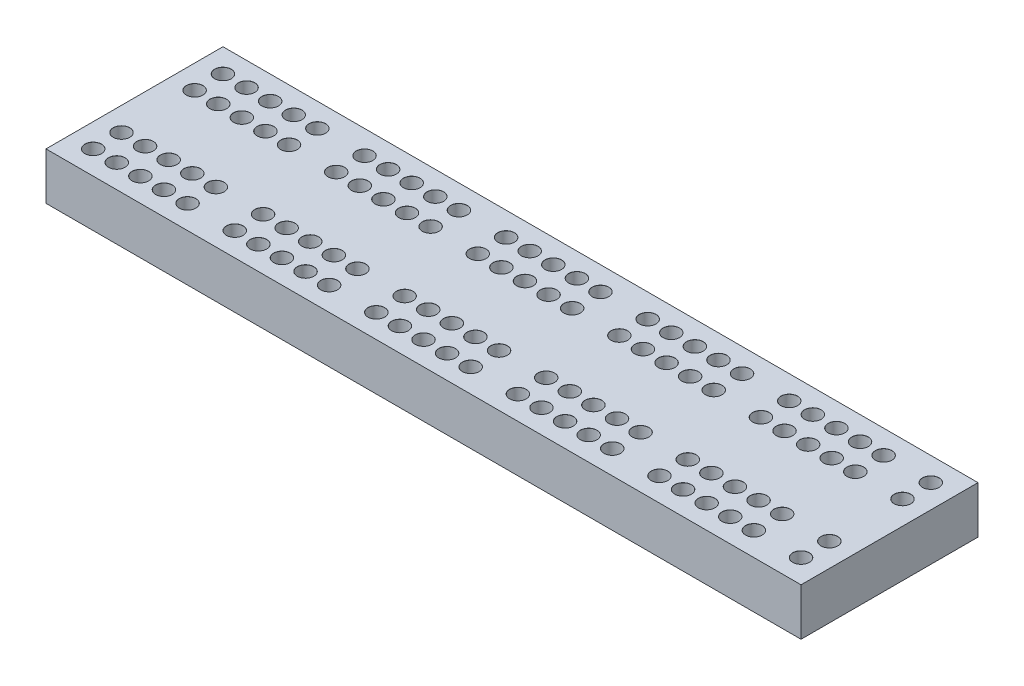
from build123d import *

# Parameters (mm, degrees)
SKETCH1_W            = 320
SKETCH1_H            = 75
BOSS_EXTRUDE1_DEPTH  = 20
LPATTERN1_COUNT      = 2
LPATTERN1_PITCH      = 12
LPATTERN1_COUNT_DIR2 = 5
LPATTERN1_PITCH_DIR2 = 10
LPATTERN3_COUNT      = 5
LPATTERN3_PITCH      = 60
LPATTERN4_COUNT      = 2
LPATTERN4_PITCH      = 300
LPATTERN4_COUNT_DIR2 = 2
LPATTERN4_PITCH_DIR2 = 12


with BuildPart() as part:
    # Sketch1 → Boss-Extrude1 (new body)
    with BuildSketch(Plane(origin=(0, 0, 0), x_dir=(1, 0, 0), z_dir=(0, 1, 0))):
        Rectangle(SKETCH1_W, SKETCH1_H)
    extrude(amount=BOSS_EXTRUDE1_DEPTH)

    # Sketch4 → 7.0 _7_ Diameter Hole1 (revolve, cut)
    with BuildSketch(Plane(origin=(-150, 20, -27.5), x_dir=(0, 0, 1), z_dir=(1, 0, 0))):
        Polygon((0, 0), (0, 14.103012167), (3.5, 12), (3.5, 0.025), (3.525, 0), align=None)
    f_7_0_7_diameter_hole1 = revolve(axis=Axis((-150, 26.35, -27.5), (0, -1, 0)), mode=Mode.SUBTRACT)

    # LPattern1: 7.0 _7_ Diameter Hole1 2 × 5
    with Locations(*[(j * LPATTERN1_PITCH_DIR2, 0, i * LPATTERN1_PITCH) for i in range(LPATTERN1_COUNT) for j in range(LPATTERN1_COUNT_DIR2) if (i, j) != (0, 0)]):
        add(f_7_0_7_diameter_hole1, mode=Mode.SUBTRACT)

    # LPattern3: 7.0 _7_ Diameter Hole1 ×5
    with Locations(*[(i * LPATTERN3_PITCH, 0, 0) for i in range(1, LPATTERN3_COUNT)]):
        add(f_7_0_7_diameter_hole1, mode=Mode.SUBTRACT)

    # LPattern3 copy 1 sketch → LPattern3 copy 1 (revolve, cut)
    with BuildSketch(Plane(origin=(-80, 20, -27.5), x_dir=(0, 0, 1), z_dir=(1, 0, 0))):
        Polygon((0, 0), (0, 14.103012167), (3.5, 12), (3.5, 0.025), (3.525, 0), align=None)
    revolve(axis=Axis((-80, 26.35, -27.5), (0, -1, 0)), mode=Mode.SUBTRACT)

    # LPattern3 copy 2 sketch → LPattern3 copy 2 (revolve, cut)
    with BuildSketch(Plane(origin=(-20, 20, -27.5), x_dir=(0, 0, 1), z_dir=(1, 0, 0))):
        Polygon((0, 0), (0, 14.103012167), (3.5, 12), (3.5, 0.025), (3.525, 0), align=None)
    revolve(axis=Axis((-20, 26.35, -27.5), (0, -1, 0)), mode=Mode.SUBTRACT)

    # LPattern3 copy 3 sketch → LPattern3 copy 3 (revolve, cut)
    with BuildSketch(Plane(origin=(40, 20, -27.5), x_dir=(0, 0, 1), z_dir=(1, 0, 0))):
        Polygon((0, 0), (0, 14.103012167), (3.5, 12), (3.5, 0.025), (3.525, 0), align=None)
    revolve(axis=Axis((40, 26.35, -27.5), (0, -1, 0)), mode=Mode.SUBTRACT)

    # LPattern3 copy 4 sketch → LPattern3 copy 4 (revolve, cut)
    with BuildSketch(Plane(origin=(100, 20, -27.5), x_dir=(0, 0, 1), z_dir=(1, 0, 0))):
        Polygon((0, 0), (0, 14.103012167), (3.5, 12), (3.5, 0.025), (3.525, 0), align=None)
    revolve(axis=Axis((100, 26.35, -27.5), (0, -1, 0)), mode=Mode.SUBTRACT)

    # LPattern3 copy 5 sketch → LPattern3 copy 5 (revolve, cut)
    with BuildSketch(Plane(origin=(-70, 20, -27.5), x_dir=(0, 0, 1), z_dir=(1, 0, 0))):
        Polygon((0, 0), (0, 14.103012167), (3.5, 12), (3.5, 0.025), (3.525, 0), align=None)
    revolve(axis=Axis((-70, 26.35, -27.5), (0, -1, 0)), mode=Mode.SUBTRACT)

    # LPattern3 copy 6 sketch → LPattern3 copy 6 (revolve, cut)
    with BuildSketch(Plane(origin=(-10, 20, -27.5), x_dir=(0, 0, 1), z_dir=(1, 0, 0))):
        Polygon((0, 0), (0, 14.103012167), (3.5, 12), (3.5, 0.025), (3.525, 0), align=None)
    revolve(axis=Axis((-10, 26.35, -27.5), (0, -1, 0)), mode=Mode.SUBTRACT)

    # LPattern3 copy 7 sketch → LPattern3 copy 7 (revolve, cut)
    with BuildSketch(Plane(origin=(50, 20, -27.5), x_dir=(0, 0, 1), z_dir=(1, 0, 0))):
        Polygon((0, 0), (0, 14.103012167), (3.5, 12), (3.5, 0.025), (3.525, 0), align=None)
    revolve(axis=Axis((50, 26.35, -27.5), (0, -1, 0)), mode=Mode.SUBTRACT)

    # LPattern3 copy 8 sketch → LPattern3 copy 8 (revolve, cut)
    with BuildSketch(Plane(origin=(110, 20, -27.5), x_dir=(0, 0, 1), z_dir=(1, 0, 0))):
        Polygon((0, 0), (0, 14.103012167), (3.5, 12), (3.5, 0.025), (3.525, 0), align=None)
    revolve(axis=Axis((110, 26.35, -27.5), (0, -1, 0)), mode=Mode.SUBTRACT)

    # LPattern3 copy 9 sketch → LPattern3 copy 9 (revolve, cut)
    with BuildSketch(Plane(origin=(-60, 20, -27.5), x_dir=(0, 0, 1), z_dir=(1, 0, 0))):
        Polygon((0, 0), (0, 14.103012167), (3.5, 12), (3.5, 0.025), (3.525, 0), align=None)
    revolve(axis=Axis((-60, 26.35, -27.5), (0, -1, 0)), mode=Mode.SUBTRACT)

    # LPattern3 copy 10 sketch → LPattern3 copy 10 (revolve, cut)
    with BuildSketch(Plane(origin=(0, 20, -27.5), x_dir=(0, 0, 1), z_dir=(1, 0, 0))):
        Polygon((0, 0), (0, 14.103012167), (3.5, 12), (3.5, 0.025), (3.525, 0), align=None)
    revolve(axis=Axis((0, 26.35, -27.5), (0, -1, 0)), mode=Mode.SUBTRACT)

    # LPattern3 copy 11 sketch → LPattern3 copy 11 (revolve, cut)
    with BuildSketch(Plane(origin=(60, 20, -27.5), x_dir=(0, 0, 1), z_dir=(1, 0, 0))):
        Polygon((0, 0), (0, 14.103012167), (3.5, 12), (3.5, 0.025), (3.525, 0), align=None)
    revolve(axis=Axis((60, 26.35, -27.5), (0, -1, 0)), mode=Mode.SUBTRACT)

    # LPattern3 copy 12 sketch → LPattern3 copy 12 (revolve, cut)
    with BuildSketch(Plane(origin=(120, 20, -27.5), x_dir=(0, 0, 1), z_dir=(1, 0, 0))):
        Polygon((0, 0), (0, 14.103012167), (3.5, 12), (3.5, 0.025), (3.525, 0), align=None)
    revolve(axis=Axis((120, 26.35, -27.5), (0, -1, 0)), mode=Mode.SUBTRACT)

    # LPattern3 copy 13 sketch → LPattern3 copy 13 (revolve, cut)
    with BuildSketch(Plane(origin=(-50, 20, -27.5), x_dir=(0, 0, 1), z_dir=(1, 0, 0))):
        Polygon((0, 0), (0, 14.103012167), (3.5, 12), (3.5, 0.025), (3.525, 0), align=None)
    revolve(axis=Axis((-50, 26.35, -27.5), (0, -1, 0)), mode=Mode.SUBTRACT)

    # LPattern3 copy 14 sketch → LPattern3 copy 14 (revolve, cut)
    with BuildSketch(Plane(origin=(10, 20, -27.5), x_dir=(0, 0, 1), z_dir=(1, 0, 0))):
        Polygon((0, 0), (0, 14.103012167), (3.5, 12), (3.5, 0.025), (3.525, 0), align=None)
    revolve(axis=Axis((10, 26.35, -27.5), (0, -1, 0)), mode=Mode.SUBTRACT)

    # LPattern3 copy 15 sketch → LPattern3 copy 15 (revolve, cut)
    with BuildSketch(Plane(origin=(70, 20, -27.5), x_dir=(0, 0, 1), z_dir=(1, 0, 0))):
        Polygon((0, 0), (0, 14.103012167), (3.5, 12), (3.5, 0.025), (3.525, 0), align=None)
    revolve(axis=Axis((70, 26.35, -27.5), (0, -1, 0)), mode=Mode.SUBTRACT)

    # LPattern3 copy 16 sketch → LPattern3 copy 16 (revolve, cut)
    with BuildSketch(Plane(origin=(130, 20, -27.5), x_dir=(0, 0, 1), z_dir=(1, 0, 0))):
        Polygon((0, 0), (0, 14.103012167), (3.5, 12), (3.5, 0.025), (3.525, 0), align=None)
    revolve(axis=Axis((130, 26.35, -27.5), (0, -1, 0)), mode=Mode.SUBTRACT)

    # LPattern3 copy 17 sketch → LPattern3 copy 17 (revolve, cut)
    with BuildSketch(Plane(origin=(-90, 20, -15.5), x_dir=(0, 0, 1), z_dir=(1, 0, 0))):
        Polygon((0, 0), (0, 14.103012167), (3.5, 12), (3.5, 0.025), (3.525, 0), align=None)
    revolve(axis=Axis((-90, 26.35, -15.5), (0, -1, 0)), mode=Mode.SUBTRACT)

    # LPattern3 copy 18 sketch → LPattern3 copy 18 (revolve, cut)
    with BuildSketch(Plane(origin=(-30, 20, -15.5), x_dir=(0, 0, 1), z_dir=(1, 0, 0))):
        Polygon((0, 0), (0, 14.103012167), (3.5, 12), (3.5, 0.025), (3.525, 0), align=None)
    revolve(axis=Axis((-30, 26.35, -15.5), (0, -1, 0)), mode=Mode.SUBTRACT)

    # LPattern3 copy 19 sketch → LPattern3 copy 19 (revolve, cut)
    with BuildSketch(Plane(origin=(30, 20, -15.5), x_dir=(0, 0, 1), z_dir=(1, 0, 0))):
        Polygon((0, 0), (0, 14.103012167), (3.5, 12), (3.5, 0.025), (3.525, 0), align=None)
    revolve(axis=Axis((30, 26.35, -15.5), (0, -1, 0)), mode=Mode.SUBTRACT)

    # LPattern3 copy 20 sketch → LPattern3 copy 20 (revolve, cut)
    with BuildSketch(Plane(origin=(90, 20, -15.5), x_dir=(0, 0, 1), z_dir=(1, 0, 0))):
        Polygon((0, 0), (0, 14.103012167), (3.5, 12), (3.5, 0.025), (3.525, 0), align=None)
    revolve(axis=Axis((90, 26.35, -15.5), (0, -1, 0)), mode=Mode.SUBTRACT)

    # LPattern3 copy 21 sketch → LPattern3 copy 21 (revolve, cut)
    with BuildSketch(Plane(origin=(-80, 20, -15.5), x_dir=(0, 0, 1), z_dir=(1, 0, 0))):
        Polygon((0, 0), (0, 14.103012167), (3.5, 12), (3.5, 0.025), (3.525, 0), align=None)
    revolve(axis=Axis((-80, 26.35, -15.5), (0, -1, 0)), mode=Mode.SUBTRACT)

    # LPattern3 copy 22 sketch → LPattern3 copy 22 (revolve, cut)
    with BuildSketch(Plane(origin=(-20, 20, -15.5), x_dir=(0, 0, 1), z_dir=(1, 0, 0))):
        Polygon((0, 0), (0, 14.103012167), (3.5, 12), (3.5, 0.025), (3.525, 0), align=None)
    revolve(axis=Axis((-20, 26.35, -15.5), (0, -1, 0)), mode=Mode.SUBTRACT)

    # LPattern3 copy 23 sketch → LPattern3 copy 23 (revolve, cut)
    with BuildSketch(Plane(origin=(40, 20, -15.5), x_dir=(0, 0, 1), z_dir=(1, 0, 0))):
        Polygon((0, 0), (0, 14.103012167), (3.5, 12), (3.5, 0.025), (3.525, 0), align=None)
    revolve(axis=Axis((40, 26.35, -15.5), (0, -1, 0)), mode=Mode.SUBTRACT)

    # LPattern3 copy 24 sketch → LPattern3 copy 24 (revolve, cut)
    with BuildSketch(Plane(origin=(100, 20, -15.5), x_dir=(0, 0, 1), z_dir=(1, 0, 0))):
        Polygon((0, 0), (0, 14.103012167), (3.5, 12), (3.5, 0.025), (3.525, 0), align=None)
    revolve(axis=Axis((100, 26.35, -15.5), (0, -1, 0)), mode=Mode.SUBTRACT)

    # LPattern3 copy 25 sketch → LPattern3 copy 25 (revolve, cut)
    with BuildSketch(Plane(origin=(-70, 20, -15.5), x_dir=(0, 0, 1), z_dir=(1, 0, 0))):
        Polygon((0, 0), (0, 14.103012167), (3.5, 12), (3.5, 0.025), (3.525, 0), align=None)
    revolve(axis=Axis((-70, 26.35, -15.5), (0, -1, 0)), mode=Mode.SUBTRACT)

    # LPattern3 copy 26 sketch → LPattern3 copy 26 (revolve, cut)
    with BuildSketch(Plane(origin=(-10, 20, -15.5), x_dir=(0, 0, 1), z_dir=(1, 0, 0))):
        Polygon((0, 0), (0, 14.103012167), (3.5, 12), (3.5, 0.025), (3.525, 0), align=None)
    revolve(axis=Axis((-10, 26.35, -15.5), (0, -1, 0)), mode=Mode.SUBTRACT)

    # LPattern3 copy 27 sketch → LPattern3 copy 27 (revolve, cut)
    with BuildSketch(Plane(origin=(50, 20, -15.5), x_dir=(0, 0, 1), z_dir=(1, 0, 0))):
        Polygon((0, 0), (0, 14.103012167), (3.5, 12), (3.5, 0.025), (3.525, 0), align=None)
    revolve(axis=Axis((50, 26.35, -15.5), (0, -1, 0)), mode=Mode.SUBTRACT)

    # LPattern3 copy 28 sketch → LPattern3 copy 28 (revolve, cut)
    with BuildSketch(Plane(origin=(110, 20, -15.5), x_dir=(0, 0, 1), z_dir=(1, 0, 0))):
        Polygon((0, 0), (0, 14.103012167), (3.5, 12), (3.5, 0.025), (3.525, 0), align=None)
    revolve(axis=Axis((110, 26.35, -15.5), (0, -1, 0)), mode=Mode.SUBTRACT)

    # LPattern3 copy 29 sketch → LPattern3 copy 29 (revolve, cut)
    with BuildSketch(Plane(origin=(-60, 20, -15.5), x_dir=(0, 0, 1), z_dir=(1, 0, 0))):
        Polygon((0, 0), (0, 14.103012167), (3.5, 12), (3.5, 0.025), (3.525, 0), align=None)
    revolve(axis=Axis((-60, 26.35, -15.5), (0, -1, 0)), mode=Mode.SUBTRACT)

    # LPattern3 copy 30 sketch → LPattern3 copy 30 (revolve, cut)
    with BuildSketch(Plane(origin=(0, 20, -15.5), x_dir=(0, 0, 1), z_dir=(1, 0, 0))):
        Polygon((0, 0), (0, 14.103012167), (3.5, 12), (3.5, 0.025), (3.525, 0), align=None)
    revolve(axis=Axis((0, 26.35, -15.5), (0, -1, 0)), mode=Mode.SUBTRACT)

    # LPattern3 copy 31 sketch → LPattern3 copy 31 (revolve, cut)
    with BuildSketch(Plane(origin=(60, 20, -15.5), x_dir=(0, 0, 1), z_dir=(1, 0, 0))):
        Polygon((0, 0), (0, 14.103012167), (3.5, 12), (3.5, 0.025), (3.525, 0), align=None)
    revolve(axis=Axis((60, 26.35, -15.5), (0, -1, 0)), mode=Mode.SUBTRACT)

    # LPattern3 copy 32 sketch → LPattern3 copy 32 (revolve, cut)
    with BuildSketch(Plane(origin=(120, 20, -15.5), x_dir=(0, 0, 1), z_dir=(1, 0, 0))):
        Polygon((0, 0), (0, 14.103012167), (3.5, 12), (3.5, 0.025), (3.525, 0), align=None)
    revolve(axis=Axis((120, 26.35, -15.5), (0, -1, 0)), mode=Mode.SUBTRACT)

    # LPattern3 copy 33 sketch → LPattern3 copy 33 (revolve, cut)
    with BuildSketch(Plane(origin=(-50, 20, -15.5), x_dir=(0, 0, 1), z_dir=(1, 0, 0))):
        Polygon((0, 0), (0, 14.103012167), (3.5, 12), (3.5, 0.025), (3.525, 0), align=None)
    revolve(axis=Axis((-50, 26.35, -15.5), (0, -1, 0)), mode=Mode.SUBTRACT)

    # LPattern3 copy 34 sketch → LPattern3 copy 34 (revolve, cut)
    with BuildSketch(Plane(origin=(10, 20, -15.5), x_dir=(0, 0, 1), z_dir=(1, 0, 0))):
        Polygon((0, 0), (0, 14.103012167), (3.5, 12), (3.5, 0.025), (3.525, 0), align=None)
    revolve(axis=Axis((10, 26.35, -15.5), (0, -1, 0)), mode=Mode.SUBTRACT)

    # LPattern3 copy 35 sketch → LPattern3 copy 35 (revolve, cut)
    with BuildSketch(Plane(origin=(70, 20, -15.5), x_dir=(0, 0, 1), z_dir=(1, 0, 0))):
        Polygon((0, 0), (0, 14.103012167), (3.5, 12), (3.5, 0.025), (3.525, 0), align=None)
    revolve(axis=Axis((70, 26.35, -15.5), (0, -1, 0)), mode=Mode.SUBTRACT)

    # LPattern3 copy 36 sketch → LPattern3 copy 36 (revolve, cut)
    with BuildSketch(Plane(origin=(130, 20, -15.5), x_dir=(0, 0, 1), z_dir=(1, 0, 0))):
        Polygon((0, 0), (0, 14.103012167), (3.5, 12), (3.5, 0.025), (3.525, 0), align=None)
    revolve(axis=Axis((130, 26.35, -15.5), (0, -1, 0)), mode=Mode.SUBTRACT)

    # LPattern4: 7.0 _7_ Diameter Hole1 2 × 2, 1 skipped
    with Locations(*[(i * LPATTERN4_PITCH, 0, j * LPATTERN4_PITCH_DIR2) for i in range(LPATTERN4_COUNT) for j in range(LPATTERN4_COUNT_DIR2) if (i, j) not in ((0, 0), (0, 1))]):
        add(f_7_0_7_diameter_hole1, mode=Mode.SUBTRACT)

    # Mirror2: 7.0 _7_ Diameter Hole1 across plane
    add(f_7_0_7_diameter_hole1.mirror(Plane.XY), mode=Mode.SUBTRACT)

    # Mirror2 copy 1 sketch → Mirror2 copy 1 (revolve, cut)
    with BuildSketch(Plane(origin=(-140, 20, 27.5), x_dir=(0, 0, -1), z_dir=(1, 0, 0))):
        Polygon((0, 0), (0, -14.103012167), (3.5, -12), (3.5, -0.025), (3.525, 0), align=None)
    revolve(axis=Axis((-140, 26.35, 27.5), (0, 1, 0)), mode=Mode.SUBTRACT)

    # Mirror2 copy 2 sketch → Mirror2 copy 2 (revolve, cut)
    with BuildSketch(Plane(origin=(-130, 20, 27.5), x_dir=(0, 0, -1), z_dir=(1, 0, 0))):
        Polygon((0, 0), (0, -14.103012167), (3.5, -12), (3.5, -0.025), (3.525, 0), align=None)
    revolve(axis=Axis((-130, 26.35, 27.5), (0, 1, 0)), mode=Mode.SUBTRACT)

    # Mirror2 copy 3 sketch → Mirror2 copy 3 (revolve, cut)
    with BuildSketch(Plane(origin=(-120, 20, 27.5), x_dir=(0, 0, -1), z_dir=(1, 0, 0))):
        Polygon((0, 0), (0, -14.103012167), (3.5, -12), (3.5, -0.025), (3.525, 0), align=None)
    revolve(axis=Axis((-120, 26.35, 27.5), (0, 1, 0)), mode=Mode.SUBTRACT)

    # Mirror2 copy 4 sketch → Mirror2 copy 4 (revolve, cut)
    with BuildSketch(Plane(origin=(-110, 20, 27.5), x_dir=(0, 0, -1), z_dir=(1, 0, 0))):
        Polygon((0, 0), (0, -14.103012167), (3.5, -12), (3.5, -0.025), (3.525, 0), align=None)
    revolve(axis=Axis((-110, 26.35, 27.5), (0, 1, 0)), mode=Mode.SUBTRACT)

    # Mirror2 copy 5 sketch → Mirror2 copy 5 (revolve, cut)
    with BuildSketch(Plane(origin=(-150, 20, 15.5), x_dir=(0, 0, -1), z_dir=(1, 0, 0))):
        Polygon((0, 0), (0, -14.103012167), (3.5, -12), (3.5, -0.025), (3.525, 0), align=None)
    revolve(axis=Axis((-150, 26.35, 15.5), (0, 1, 0)), mode=Mode.SUBTRACT)

    # Mirror2 copy 6 sketch → Mirror2 copy 6 (revolve, cut)
    with BuildSketch(Plane(origin=(-140, 20, 15.5), x_dir=(0, 0, -1), z_dir=(1, 0, 0))):
        Polygon((0, 0), (0, -14.103012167), (3.5, -12), (3.5, -0.025), (3.525, 0), align=None)
    revolve(axis=Axis((-140, 26.35, 15.5), (0, 1, 0)), mode=Mode.SUBTRACT)

    # Mirror2 copy 7 sketch → Mirror2 copy 7 (revolve, cut)
    with BuildSketch(Plane(origin=(-130, 20, 15.5), x_dir=(0, 0, -1), z_dir=(1, 0, 0))):
        Polygon((0, 0), (0, -14.103012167), (3.5, -12), (3.5, -0.025), (3.525, 0), align=None)
    revolve(axis=Axis((-130, 26.35, 15.5), (0, 1, 0)), mode=Mode.SUBTRACT)

    # Mirror2 copy 8 sketch → Mirror2 copy 8 (revolve, cut)
    with BuildSketch(Plane(origin=(-120, 20, 15.5), x_dir=(0, 0, -1), z_dir=(1, 0, 0))):
        Polygon((0, 0), (0, -14.103012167), (3.5, -12), (3.5, -0.025), (3.525, 0), align=None)
    revolve(axis=Axis((-120, 26.35, 15.5), (0, 1, 0)), mode=Mode.SUBTRACT)

    # Mirror2 copy 9 sketch → Mirror2 copy 9 (revolve, cut)
    with BuildSketch(Plane(origin=(-110, 20, 15.5), x_dir=(0, 0, -1), z_dir=(1, 0, 0))):
        Polygon((0, 0), (0, -14.103012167), (3.5, -12), (3.5, -0.025), (3.525, 0), align=None)
    revolve(axis=Axis((-110, 26.35, 15.5), (0, 1, 0)), mode=Mode.SUBTRACT)

    # Mirror2 copy 10 sketch → Mirror2 copy 10 (revolve, cut)
    with BuildSketch(Plane(origin=(-90, 20, 27.5), x_dir=(0, 0, -1), z_dir=(1, 0, 0))):
        Polygon((0, 0), (0, -14.103012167), (3.5, -12), (3.5, -0.025), (3.525, 0), align=None)
    revolve(axis=Axis((-90, 26.35, 27.5), (0, 1, 0)), mode=Mode.SUBTRACT)

    # Mirror2 copy 11 sketch → Mirror2 copy 11 (revolve, cut)
    with BuildSketch(Plane(origin=(-30, 20, 27.5), x_dir=(0, 0, -1), z_dir=(1, 0, 0))):
        Polygon((0, 0), (0, -14.103012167), (3.5, -12), (3.5, -0.025), (3.525, 0), align=None)
    revolve(axis=Axis((-30, 26.35, 27.5), (0, 1, 0)), mode=Mode.SUBTRACT)

    # Mirror2 copy 12 sketch → Mirror2 copy 12 (revolve, cut)
    with BuildSketch(Plane(origin=(30, 20, 27.5), x_dir=(0, 0, -1), z_dir=(1, 0, 0))):
        Polygon((0, 0), (0, -14.103012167), (3.5, -12), (3.5, -0.025), (3.525, 0), align=None)
    revolve(axis=Axis((30, 26.35, 27.5), (0, 1, 0)), mode=Mode.SUBTRACT)

    # Mirror2 copy 13 sketch → Mirror2 copy 13 (revolve, cut)
    with BuildSketch(Plane(origin=(90, 20, 27.5), x_dir=(0, 0, -1), z_dir=(1, 0, 0))):
        Polygon((0, 0), (0, -14.103012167), (3.5, -12), (3.5, -0.025), (3.525, 0), align=None)
    revolve(axis=Axis((90, 26.35, 27.5), (0, 1, 0)), mode=Mode.SUBTRACT)

    # Mirror2 copy 14 sketch → Mirror2 copy 14 (revolve, cut)
    with BuildSketch(Plane(origin=(-80, 20, 27.5), x_dir=(0, 0, -1), z_dir=(1, 0, 0))):
        Polygon((0, 0), (0, -14.103012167), (3.5, -12), (3.5, -0.025), (3.525, 0), align=None)
    revolve(axis=Axis((-80, 26.35, 27.5), (0, 1, 0)), mode=Mode.SUBTRACT)

    # Mirror2 copy 15 sketch → Mirror2 copy 15 (revolve, cut)
    with BuildSketch(Plane(origin=(-20, 20, 27.5), x_dir=(0, 0, -1), z_dir=(1, 0, 0))):
        Polygon((0, 0), (0, -14.103012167), (3.5, -12), (3.5, -0.025), (3.525, 0), align=None)
    revolve(axis=Axis((-20, 26.35, 27.5), (0, 1, 0)), mode=Mode.SUBTRACT)

    # Mirror2 copy 16 sketch → Mirror2 copy 16 (revolve, cut)
    with BuildSketch(Plane(origin=(40, 20, 27.5), x_dir=(0, 0, -1), z_dir=(1, 0, 0))):
        Polygon((0, 0), (0, -14.103012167), (3.5, -12), (3.5, -0.025), (3.525, 0), align=None)
    revolve(axis=Axis((40, 26.35, 27.5), (0, 1, 0)), mode=Mode.SUBTRACT)

    # Mirror2 copy 17 sketch → Mirror2 copy 17 (revolve, cut)
    with BuildSketch(Plane(origin=(100, 20, 27.5), x_dir=(0, 0, -1), z_dir=(1, 0, 0))):
        Polygon((0, 0), (0, -14.103012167), (3.5, -12), (3.5, -0.025), (3.525, 0), align=None)
    revolve(axis=Axis((100, 26.35, 27.5), (0, 1, 0)), mode=Mode.SUBTRACT)

    # Mirror2 copy 18 sketch → Mirror2 copy 18 (revolve, cut)
    with BuildSketch(Plane(origin=(-70, 20, 27.5), x_dir=(0, 0, -1), z_dir=(1, 0, 0))):
        Polygon((0, 0), (0, -14.103012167), (3.5, -12), (3.5, -0.025), (3.525, 0), align=None)
    revolve(axis=Axis((-70, 26.35, 27.5), (0, 1, 0)), mode=Mode.SUBTRACT)

    # Mirror2 copy 19 sketch → Mirror2 copy 19 (revolve, cut)
    with BuildSketch(Plane(origin=(-10, 20, 27.5), x_dir=(0, 0, -1), z_dir=(1, 0, 0))):
        Polygon((0, 0), (0, -14.103012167), (3.5, -12), (3.5, -0.025), (3.525, 0), align=None)
    revolve(axis=Axis((-10, 26.35, 27.5), (0, 1, 0)), mode=Mode.SUBTRACT)

    # Mirror2 copy 20 sketch → Mirror2 copy 20 (revolve, cut)
    with BuildSketch(Plane(origin=(50, 20, 27.5), x_dir=(0, 0, -1), z_dir=(1, 0, 0))):
        Polygon((0, 0), (0, -14.103012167), (3.5, -12), (3.5, -0.025), (3.525, 0), align=None)
    revolve(axis=Axis((50, 26.35, 27.5), (0, 1, 0)), mode=Mode.SUBTRACT)

    # Mirror2 copy 21 sketch → Mirror2 copy 21 (revolve, cut)
    with BuildSketch(Plane(origin=(110, 20, 27.5), x_dir=(0, 0, -1), z_dir=(1, 0, 0))):
        Polygon((0, 0), (0, -14.103012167), (3.5, -12), (3.5, -0.025), (3.525, 0), align=None)
    revolve(axis=Axis((110, 26.35, 27.5), (0, 1, 0)), mode=Mode.SUBTRACT)

    # Mirror2 copy 22 sketch → Mirror2 copy 22 (revolve, cut)
    with BuildSketch(Plane(origin=(-60, 20, 27.5), x_dir=(0, 0, -1), z_dir=(1, 0, 0))):
        Polygon((0, 0), (0, -14.103012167), (3.5, -12), (3.5, -0.025), (3.525, 0), align=None)
    revolve(axis=Axis((-60, 26.35, 27.5), (0, 1, 0)), mode=Mode.SUBTRACT)

    # Mirror2 copy 23 sketch → Mirror2 copy 23 (revolve, cut)
    with BuildSketch(Plane(origin=(0, 20, 27.5), x_dir=(0, 0, -1), z_dir=(1, 0, 0))):
        Polygon((0, 0), (0, -14.103012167), (3.5, -12), (3.5, -0.025), (3.525, 0), align=None)
    revolve(axis=Axis((0, 26.35, 27.5), (0, 1, 0)), mode=Mode.SUBTRACT)

    # Mirror2 copy 24 sketch → Mirror2 copy 24 (revolve, cut)
    with BuildSketch(Plane(origin=(60, 20, 27.5), x_dir=(0, 0, -1), z_dir=(1, 0, 0))):
        Polygon((0, 0), (0, -14.103012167), (3.5, -12), (3.5, -0.025), (3.525, 0), align=None)
    revolve(axis=Axis((60, 26.35, 27.5), (0, 1, 0)), mode=Mode.SUBTRACT)

    # Mirror2 copy 25 sketch → Mirror2 copy 25 (revolve, cut)
    with BuildSketch(Plane(origin=(120, 20, 27.5), x_dir=(0, 0, -1), z_dir=(1, 0, 0))):
        Polygon((0, 0), (0, -14.103012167), (3.5, -12), (3.5, -0.025), (3.525, 0), align=None)
    revolve(axis=Axis((120, 26.35, 27.5), (0, 1, 0)), mode=Mode.SUBTRACT)

    # Mirror2 copy 26 sketch → Mirror2 copy 26 (revolve, cut)
    with BuildSketch(Plane(origin=(-50, 20, 27.5), x_dir=(0, 0, -1), z_dir=(1, 0, 0))):
        Polygon((0, 0), (0, -14.103012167), (3.5, -12), (3.5, -0.025), (3.525, 0), align=None)
    revolve(axis=Axis((-50, 26.35, 27.5), (0, 1, 0)), mode=Mode.SUBTRACT)

    # Mirror2 copy 27 sketch → Mirror2 copy 27 (revolve, cut)
    with BuildSketch(Plane(origin=(10, 20, 27.5), x_dir=(0, 0, -1), z_dir=(1, 0, 0))):
        Polygon((0, 0), (0, -14.103012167), (3.5, -12), (3.5, -0.025), (3.525, 0), align=None)
    revolve(axis=Axis((10, 26.35, 27.5), (0, 1, 0)), mode=Mode.SUBTRACT)

    # Mirror2 copy 28 sketch → Mirror2 copy 28 (revolve, cut)
    with BuildSketch(Plane(origin=(70, 20, 27.5), x_dir=(0, 0, -1), z_dir=(1, 0, 0))):
        Polygon((0, 0), (0, -14.103012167), (3.5, -12), (3.5, -0.025), (3.525, 0), align=None)
    revolve(axis=Axis((70, 26.35, 27.5), (0, 1, 0)), mode=Mode.SUBTRACT)

    # Mirror2 copy 29 sketch → Mirror2 copy 29 (revolve, cut)
    with BuildSketch(Plane(origin=(130, 20, 27.5), x_dir=(0, 0, -1), z_dir=(1, 0, 0))):
        Polygon((0, 0), (0, -14.103012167), (3.5, -12), (3.5, -0.025), (3.525, 0), align=None)
    revolve(axis=Axis((130, 26.35, 27.5), (0, 1, 0)), mode=Mode.SUBTRACT)

    # Mirror2 copy 30 sketch → Mirror2 copy 30 (revolve, cut)
    with BuildSketch(Plane(origin=(-90, 20, 15.5), x_dir=(0, 0, -1), z_dir=(1, 0, 0))):
        Polygon((0, 0), (0, -14.103012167), (3.5, -12), (3.5, -0.025), (3.525, 0), align=None)
    revolve(axis=Axis((-90, 26.35, 15.5), (0, 1, 0)), mode=Mode.SUBTRACT)

    # Mirror2 copy 31 sketch → Mirror2 copy 31 (revolve, cut)
    with BuildSketch(Plane(origin=(-30, 20, 15.5), x_dir=(0, 0, -1), z_dir=(1, 0, 0))):
        Polygon((0, 0), (0, -14.103012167), (3.5, -12), (3.5, -0.025), (3.525, 0), align=None)
    revolve(axis=Axis((-30, 26.35, 15.5), (0, 1, 0)), mode=Mode.SUBTRACT)

    # Mirror2 copy 32 sketch → Mirror2 copy 32 (revolve, cut)
    with BuildSketch(Plane(origin=(30, 20, 15.5), x_dir=(0, 0, -1), z_dir=(1, 0, 0))):
        Polygon((0, 0), (0, -14.103012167), (3.5, -12), (3.5, -0.025), (3.525, 0), align=None)
    revolve(axis=Axis((30, 26.35, 15.5), (0, 1, 0)), mode=Mode.SUBTRACT)

    # Mirror2 copy 33 sketch → Mirror2 copy 33 (revolve, cut)
    with BuildSketch(Plane(origin=(90, 20, 15.5), x_dir=(0, 0, -1), z_dir=(1, 0, 0))):
        Polygon((0, 0), (0, -14.103012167), (3.5, -12), (3.5, -0.025), (3.525, 0), align=None)
    revolve(axis=Axis((90, 26.35, 15.5), (0, 1, 0)), mode=Mode.SUBTRACT)

    # Mirror2 copy 34 sketch → Mirror2 copy 34 (revolve, cut)
    with BuildSketch(Plane(origin=(-80, 20, 15.5), x_dir=(0, 0, -1), z_dir=(1, 0, 0))):
        Polygon((0, 0), (0, -14.103012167), (3.5, -12), (3.5, -0.025), (3.525, 0), align=None)
    revolve(axis=Axis((-80, 26.35, 15.5), (0, 1, 0)), mode=Mode.SUBTRACT)

    # Mirror2 copy 35 sketch → Mirror2 copy 35 (revolve, cut)
    with BuildSketch(Plane(origin=(-20, 20, 15.5), x_dir=(0, 0, -1), z_dir=(1, 0, 0))):
        Polygon((0, 0), (0, -14.103012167), (3.5, -12), (3.5, -0.025), (3.525, 0), align=None)
    revolve(axis=Axis((-20, 26.35, 15.5), (0, 1, 0)), mode=Mode.SUBTRACT)

    # Mirror2 copy 36 sketch → Mirror2 copy 36 (revolve, cut)
    with BuildSketch(Plane(origin=(40, 20, 15.5), x_dir=(0, 0, -1), z_dir=(1, 0, 0))):
        Polygon((0, 0), (0, -14.103012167), (3.5, -12), (3.5, -0.025), (3.525, 0), align=None)
    revolve(axis=Axis((40, 26.35, 15.5), (0, 1, 0)), mode=Mode.SUBTRACT)

    # Mirror2 copy 37 sketch → Mirror2 copy 37 (revolve, cut)
    with BuildSketch(Plane(origin=(100, 20, 15.5), x_dir=(0, 0, -1), z_dir=(1, 0, 0))):
        Polygon((0, 0), (0, -14.103012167), (3.5, -12), (3.5, -0.025), (3.525, 0), align=None)
    revolve(axis=Axis((100, 26.35, 15.5), (0, 1, 0)), mode=Mode.SUBTRACT)

    # Mirror2 copy 38 sketch → Mirror2 copy 38 (revolve, cut)
    with BuildSketch(Plane(origin=(-70, 20, 15.5), x_dir=(0, 0, -1), z_dir=(1, 0, 0))):
        Polygon((0, 0), (0, -14.103012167), (3.5, -12), (3.5, -0.025), (3.525, 0), align=None)
    revolve(axis=Axis((-70, 26.35, 15.5), (0, 1, 0)), mode=Mode.SUBTRACT)

    # Mirror2 copy 39 sketch → Mirror2 copy 39 (revolve, cut)
    with BuildSketch(Plane(origin=(-10, 20, 15.5), x_dir=(0, 0, -1), z_dir=(1, 0, 0))):
        Polygon((0, 0), (0, -14.103012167), (3.5, -12), (3.5, -0.025), (3.525, 0), align=None)
    revolve(axis=Axis((-10, 26.35, 15.5), (0, 1, 0)), mode=Mode.SUBTRACT)

    # Mirror2 copy 40 sketch → Mirror2 copy 40 (revolve, cut)
    with BuildSketch(Plane(origin=(50, 20, 15.5), x_dir=(0, 0, -1), z_dir=(1, 0, 0))):
        Polygon((0, 0), (0, -14.103012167), (3.5, -12), (3.5, -0.025), (3.525, 0), align=None)
    revolve(axis=Axis((50, 26.35, 15.5), (0, 1, 0)), mode=Mode.SUBTRACT)

    # Mirror2 copy 41 sketch → Mirror2 copy 41 (revolve, cut)
    with BuildSketch(Plane(origin=(110, 20, 15.5), x_dir=(0, 0, -1), z_dir=(1, 0, 0))):
        Polygon((0, 0), (0, -14.103012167), (3.5, -12), (3.5, -0.025), (3.525, 0), align=None)
    revolve(axis=Axis((110, 26.35, 15.5), (0, 1, 0)), mode=Mode.SUBTRACT)

    # Mirror2 copy 42 sketch → Mirror2 copy 42 (revolve, cut)
    with BuildSketch(Plane(origin=(-60, 20, 15.5), x_dir=(0, 0, -1), z_dir=(1, 0, 0))):
        Polygon((0, 0), (0, -14.103012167), (3.5, -12), (3.5, -0.025), (3.525, 0), align=None)
    revolve(axis=Axis((-60, 26.35, 15.5), (0, 1, 0)), mode=Mode.SUBTRACT)

    # Mirror2 copy 43 sketch → Mirror2 copy 43 (revolve, cut)
    with BuildSketch(Plane(origin=(0, 20, 15.5), x_dir=(0, 0, -1), z_dir=(1, 0, 0))):
        Polygon((0, 0), (0, -14.103012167), (3.5, -12), (3.5, -0.025), (3.525, 0), align=None)
    revolve(axis=Axis((0, 26.35, 15.5), (0, 1, 0)), mode=Mode.SUBTRACT)

    # Mirror2 copy 44 sketch → Mirror2 copy 44 (revolve, cut)
    with BuildSketch(Plane(origin=(60, 20, 15.5), x_dir=(0, 0, -1), z_dir=(1, 0, 0))):
        Polygon((0, 0), (0, -14.103012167), (3.5, -12), (3.5, -0.025), (3.525, 0), align=None)
    revolve(axis=Axis((60, 26.35, 15.5), (0, 1, 0)), mode=Mode.SUBTRACT)

    # Mirror2 copy 45 sketch → Mirror2 copy 45 (revolve, cut)
    with BuildSketch(Plane(origin=(120, 20, 15.5), x_dir=(0, 0, -1), z_dir=(1, 0, 0))):
        Polygon((0, 0), (0, -14.103012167), (3.5, -12), (3.5, -0.025), (3.525, 0), align=None)
    revolve(axis=Axis((120, 26.35, 15.5), (0, 1, 0)), mode=Mode.SUBTRACT)

    # Mirror2 copy 46 sketch → Mirror2 copy 46 (revolve, cut)
    with BuildSketch(Plane(origin=(-50, 20, 15.5), x_dir=(0, 0, -1), z_dir=(1, 0, 0))):
        Polygon((0, 0), (0, -14.103012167), (3.5, -12), (3.5, -0.025), (3.525, 0), align=None)
    revolve(axis=Axis((-50, 26.35, 15.5), (0, 1, 0)), mode=Mode.SUBTRACT)

    # Mirror2 copy 47 sketch → Mirror2 copy 47 (revolve, cut)
    with BuildSketch(Plane(origin=(10, 20, 15.5), x_dir=(0, 0, -1), z_dir=(1, 0, 0))):
        Polygon((0, 0), (0, -14.103012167), (3.5, -12), (3.5, -0.025), (3.525, 0), align=None)
    revolve(axis=Axis((10, 26.35, 15.5), (0, 1, 0)), mode=Mode.SUBTRACT)

    # Mirror2 copy 48 sketch → Mirror2 copy 48 (revolve, cut)
    with BuildSketch(Plane(origin=(70, 20, 15.5), x_dir=(0, 0, -1), z_dir=(1, 0, 0))):
        Polygon((0, 0), (0, -14.103012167), (3.5, -12), (3.5, -0.025), (3.525, 0), align=None)
    revolve(axis=Axis((70, 26.35, 15.5), (0, 1, 0)), mode=Mode.SUBTRACT)

    # Mirror2 copy 49 sketch → Mirror2 copy 49 (revolve, cut)
    with BuildSketch(Plane(origin=(130, 20, 15.5), x_dir=(0, 0, -1), z_dir=(1, 0, 0))):
        Polygon((0, 0), (0, -14.103012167), (3.5, -12), (3.5, -0.025), (3.525, 0), align=None)
    revolve(axis=Axis((130, 26.35, 15.5), (0, 1, 0)), mode=Mode.SUBTRACT)

    # Mirror2 copy 50 sketch → Mirror2 copy 50 (revolve, cut)
    with BuildSketch(Plane(origin=(150, 20, 27.5), x_dir=(0, 0, -1), z_dir=(1, 0, 0))):
        Polygon((0, 0), (0, -14.103012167), (3.5, -12), (3.5, -0.025), (3.525, 0), align=None)
    revolve(axis=Axis((150, 26.35, 27.5), (0, 1, 0)), mode=Mode.SUBTRACT)

    # Mirror2 copy 51 sketch → Mirror2 copy 51 (revolve, cut)
    with BuildSketch(Plane(origin=(150, 20, 15.5), x_dir=(0, 0, -1), z_dir=(1, 0, 0))):
        Polygon((0, 0), (0, -14.103012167), (3.5, -12), (3.5, -0.025), (3.525, 0), align=None)
    revolve(axis=Axis((150, 26.35, 15.5), (0, 1, 0)), mode=Mode.SUBTRACT)


solid = part.part
